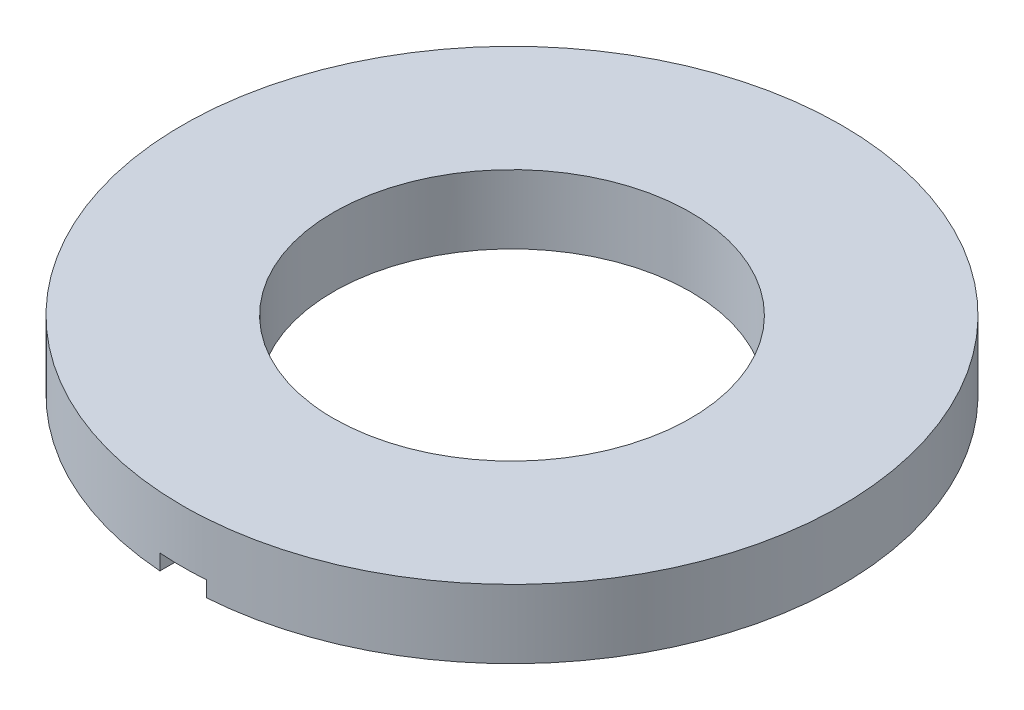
ISO-10303-21;
HEADER;
FILE_DESCRIPTION(('STEP AP214'),'2;1');
FILE_NAME('part.step','',(''),(''),'','','');
FILE_SCHEMA(('AUTOMOTIVE_DESIGN { 1 0 10303 214 1 1 1 1 }'));
ENDSEC;
DATA;
#1=APPLICATION_CONTEXT('core data for automotive mechanical design processes');
#2=APPLICATION_PROTOCOL_DEFINITION('international standard','automotive_design',2000,#1);
#3=PRODUCT_CONTEXT('',#1,'mechanical');
#4=PRODUCT('Part','Part','',(#3));
#5=PRODUCT_RELATED_PRODUCT_CATEGORY('part','',(#4));
#6=PRODUCT_DEFINITION_FORMATION('','',#4);
#7=PRODUCT_DEFINITION_CONTEXT('part definition',#1,'design');
#8=PRODUCT_DEFINITION('design','',#6,#7);
#9=PRODUCT_DEFINITION_SHAPE('','',#8);
#10=(LENGTH_UNIT() NAMED_UNIT(*) SI_UNIT(.MILLI.,.METRE.));
#11=(NAMED_UNIT(*) PLANE_ANGLE_UNIT() SI_UNIT($,.RADIAN.));
#12=(NAMED_UNIT(*) SI_UNIT($,.STERADIAN.) SOLID_ANGLE_UNIT());
#13=UNCERTAINTY_MEASURE_WITH_UNIT(LENGTH_MEASURE(1.E-05),#10,'distance_accuracy_value','');
#14=(GEOMETRIC_REPRESENTATION_CONTEXT(3) GLOBAL_UNCERTAINTY_ASSIGNED_CONTEXT((#13)) GLOBAL_UNIT_ASSIGNED_CONTEXT((#10,
#11,#12)) REPRESENTATION_CONTEXT('',''));
#15=CARTESIAN_POINT('',(0.,0.,0.));
#16=DIRECTION('',(0.,0.,1.));
#17=DIRECTION('',(1.,0.,0.));
#18=AXIS2_PLACEMENT_3D('',#15,#16,#17);
#19=CARTESIAN_POINT('',(0.,2.5,0.));
#20=DIRECTION('',(0.,1.,0.));
#21=DIRECTION('',(0.,0.,1.));
#22=AXIS2_PLACEMENT_3D('',#19,#20,#21);
#23=PLANE('',#22);
#24=CARTESIAN_POINT('',(0.,2.5,0.));
#25=DIRECTION('',(0.,1.,0.));
#26=DIRECTION('',(0.,0.,1.));
#27=AXIS2_PLACEMENT_3D('',#24,#25,#26);
#28=CIRCLE('',#27,12.);
#29=CARTESIAN_POINT('',(0.,2.5,12.));
#30=VERTEX_POINT('',#29);
#31=EDGE_CURVE('E114',#30,#30,#28,.T.);
#32=ORIENTED_EDGE('',*,*,#31,.T.);
#33=EDGE_LOOP('',(#32));
#34=FACE_BOUND('',#33,.T.);
#35=CARTESIAN_POINT('',(0.,2.5,0.));
#36=DIRECTION('',(0.,1.,0.));
#37=DIRECTION('',(0.,0.,1.));
#38=AXIS2_PLACEMENT_3D('',#35,#36,#37);
#39=CIRCLE('',#38,6.5);
#40=CARTESIAN_POINT('',(0.,2.5,6.5));
#41=VERTEX_POINT('',#40);
#42=EDGE_CURVE('E102',#41,#41,#39,.T.);
#43=ORIENTED_EDGE('',*,*,#42,.F.);
#44=EDGE_LOOP('',(#43));
#45=FACE_BOUND('',#44,.T.);
#46=ADVANCED_FACE('F39',(#34,#45),#23,.T.);
#47=CARTESIAN_POINT('',(0.,0.,0.));
#48=DIRECTION('',(0.,1.,0.));
#49=DIRECTION('',(0.,0.,1.));
#50=AXIS2_PLACEMENT_3D('',#47,#48,#49);
#51=PLANE('',#50);
#52=CARTESIAN_POINT('',(0.,0.,0.));
#53=DIRECTION('',(0.,1.,0.));
#54=DIRECTION('',(0.,0.,1.));
#55=AXIS2_PLACEMENT_3D('',#52,#53,#54);
#56=CIRCLE('',#55,12.);
#57=CARTESIAN_POINT('',(0.85,0.,11.9698579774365));
#58=VERTEX_POINT('',#57);
#59=CARTESIAN_POINT('',(-0.85,0.,11.9698579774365));
#60=VERTEX_POINT('',#59);
#61=EDGE_CURVE('E94',#58,#60,#56,.T.);
#62=ORIENTED_EDGE('',*,*,#61,.F.);
#63=DIRECTION('',(0.,0.,1.));
#64=VECTOR('',#63,1.);
#65=CARTESIAN_POINT('',(0.85,0.,1.));
#66=LINE('',#65,#64);
#67=CARTESIAN_POINT('',(0.85,0.,6.44418342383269));
#68=VERTEX_POINT('',#67);
#69=EDGE_CURVE('E81',#68,#58,#66,.T.);
#70=ORIENTED_EDGE('',*,*,#69,.F.);
#71=CARTESIAN_POINT('',(0.,0.,0.));
#72=DIRECTION('',(0.,1.,0.));
#73=DIRECTION('',(0.,0.,1.));
#74=AXIS2_PLACEMENT_3D('',#71,#72,#73);
#75=CIRCLE('',#74,6.5);
#76=CARTESIAN_POINT('',(-0.85,0.,6.44418342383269));
#77=VERTEX_POINT('',#76);
#78=EDGE_CURVE('E92',#68,#77,#75,.T.);
#79=ORIENTED_EDGE('',*,*,#78,.T.);
#80=DIRECTION('',(0.,0.,-1.));
#81=VECTOR('',#80,1.);
#82=CARTESIAN_POINT('',(-0.85,0.,1.));
#83=LINE('',#82,#81);
#84=EDGE_CURVE('E96',#60,#77,#83,.T.);
#85=ORIENTED_EDGE('',*,*,#84,.F.);
#86=EDGE_LOOP('',(#62,#70,#79,#85));
#87=FACE_BOUND('',#86,.T.);
#88=ADVANCED_FACE('F90',(#87),#51,.F.);
#89=CARTESIAN_POINT('',(0.,2.5,0.));
#90=DIRECTION('',(0.,-1.,0.));
#91=DIRECTION('',(0.,0.,-1.));
#92=AXIS2_PLACEMENT_3D('',#89,#90,#91);
#93=CYLINDRICAL_SURFACE('',#92,12.);
#94=ORIENTED_EDGE('',*,*,#31,.F.);
#95=EDGE_LOOP('',(#94));
#96=FACE_BOUND('',#95,.T.);
#97=CARTESIAN_POINT('',(0.,0.566666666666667,0.));
#98=DIRECTION('',(0.,1.,0.));
#99=DIRECTION('',(0.,0.,1.));
#100=AXIS2_PLACEMENT_3D('',#97,#98,#99);
#101=CIRCLE('',#100,12.);
#102=CARTESIAN_POINT('',(-0.85,0.566666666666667,11.9698579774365));
#103=VERTEX_POINT('',#102);
#104=CARTESIAN_POINT('',(0.85,0.566666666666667,11.9698579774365));
#105=VERTEX_POINT('',#104);
#106=EDGE_CURVE('E60',#103,#105,#101,.T.);
#107=ORIENTED_EDGE('',*,*,#106,.T.);
#108=DIRECTION('',(0.,-1.,0.));
#109=VECTOR('',#108,1.);
#110=CARTESIAN_POINT('',(0.85,2.5,11.9698579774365));
#111=LINE('',#110,#109);
#112=EDGE_CURVE('E103',#105,#58,#111,.T.);
#113=ORIENTED_EDGE('',*,*,#112,.T.);
#114=ORIENTED_EDGE('',*,*,#61,.T.);
#115=DIRECTION('',(0.,-1.,0.));
#116=VECTOR('',#115,1.);
#117=CARTESIAN_POINT('',(-0.85,2.5,11.9698579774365));
#118=LINE('',#117,#116);
#119=EDGE_CURVE('E111',#60,#103,#118,.F.);
#120=ORIENTED_EDGE('',*,*,#119,.T.);
#121=EDGE_LOOP('',(#107,#113,#114,#120));
#122=FACE_BOUND('',#121,.T.);
#123=ADVANCED_FACE('F41',(#96,#122),#93,.T.);
#124=CARTESIAN_POINT('',(0.,2.5,0.));
#125=DIRECTION('',(0.,-1.,0.));
#126=DIRECTION('',(0.,0.,-1.));
#127=AXIS2_PLACEMENT_3D('',#124,#125,#126);
#128=CYLINDRICAL_SURFACE('',#127,6.5);
#129=DIRECTION('',(0.,-1.,0.));
#130=VECTOR('',#129,1.);
#131=CARTESIAN_POINT('',(0.85,2.5,6.44418342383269));
#132=LINE('',#131,#130);
#133=CARTESIAN_POINT('',(0.85,0.566666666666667,6.44418342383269));
#134=VERTEX_POINT('',#133);
#135=EDGE_CURVE('E11',#134,#68,#132,.T.);
#136=ORIENTED_EDGE('',*,*,#135,.F.);
#137=CARTESIAN_POINT('',(0.,0.566666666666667,0.));
#138=DIRECTION('',(0.,1.,0.));
#139=DIRECTION('',(0.,0.,1.));
#140=AXIS2_PLACEMENT_3D('',#137,#138,#139);
#141=CIRCLE('',#140,6.5);
#142=CARTESIAN_POINT('',(-0.85,0.566666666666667,6.44418342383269));
#143=VERTEX_POINT('',#142);
#144=EDGE_CURVE('E117',#143,#134,#141,.T.);
#145=ORIENTED_EDGE('',*,*,#144,.F.);
#146=DIRECTION('',(0.,-1.,0.));
#147=VECTOR('',#146,1.);
#148=CARTESIAN_POINT('',(-0.85,2.5,6.44418342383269));
#149=LINE('',#148,#147);
#150=EDGE_CURVE('E48',#77,#143,#149,.F.);
#151=ORIENTED_EDGE('',*,*,#150,.F.);
#152=ORIENTED_EDGE('',*,*,#78,.F.);
#153=EDGE_LOOP('',(#136,#145,#151,#152));
#154=FACE_BOUND('',#153,.T.);
#155=ORIENTED_EDGE('',*,*,#42,.T.);
#156=EDGE_LOOP('',(#155));
#157=FACE_BOUND('',#156,.T.);
#158=ADVANCED_FACE('F99',(#154,#157),#128,.F.);
#159=CARTESIAN_POINT('',(0.85,0.566666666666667,1.));
#160=DIRECTION('',(1.,0.,0.));
#161=DIRECTION('',(0.,0.,-1.));
#162=AXIS2_PLACEMENT_3D('',#159,#160,#161);
#163=PLANE('',#162);
#164=DIRECTION('',(0.,0.,1.));
#165=VECTOR('',#164,1.);
#166=CARTESIAN_POINT('',(0.85,0.566666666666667,1.));
#167=LINE('',#166,#165);
#168=EDGE_CURVE('E83',#134,#105,#167,.T.);
#169=ORIENTED_EDGE('',*,*,#168,.F.);
#170=ORIENTED_EDGE('',*,*,#135,.T.);
#171=ORIENTED_EDGE('',*,*,#69,.T.);
#172=ORIENTED_EDGE('',*,*,#112,.F.);
#173=EDGE_LOOP('',(#169,#170,#171,#172));
#174=FACE_BOUND('',#173,.T.);
#175=ADVANCED_FACE('F79',(#174),#163,.F.);
#176=CARTESIAN_POINT('',(-0.85,0.566666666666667,1.));
#177=DIRECTION('',(-1.,0.,0.));
#178=DIRECTION('',(0.,0.,1.));
#179=AXIS2_PLACEMENT_3D('',#176,#177,#178);
#180=PLANE('',#179);
#181=ORIENTED_EDGE('',*,*,#84,.T.);
#182=ORIENTED_EDGE('',*,*,#150,.T.);
#183=DIRECTION('',(0.,0.,-1.));
#184=VECTOR('',#183,1.);
#185=CARTESIAN_POINT('',(-0.85,0.566666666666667,1.));
#186=LINE('',#185,#184);
#187=EDGE_CURVE('E55',#103,#143,#186,.T.);
#188=ORIENTED_EDGE('',*,*,#187,.F.);
#189=ORIENTED_EDGE('',*,*,#119,.F.);
#190=EDGE_LOOP('',(#181,#182,#188,#189));
#191=FACE_BOUND('',#190,.T.);
#192=ADVANCED_FACE('F124',(#191),#180,.F.);
#193=CARTESIAN_POINT('',(0.,0.566666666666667,0.));
#194=DIRECTION('',(0.,1.,0.));
#195=DIRECTION('',(0.,0.,1.));
#196=AXIS2_PLACEMENT_3D('',#193,#194,#195);
#197=PLANE('',#196);
#198=ORIENTED_EDGE('',*,*,#106,.F.);
#199=ORIENTED_EDGE('',*,*,#187,.T.);
#200=ORIENTED_EDGE('',*,*,#144,.T.);
#201=ORIENTED_EDGE('',*,*,#168,.T.);
#202=EDGE_LOOP('',(#198,#199,#200,#201));
#203=FACE_BOUND('',#202,.T.);
#204=ADVANCED_FACE('F126',(#203),#197,.F.);
#205=CLOSED_SHELL('',(#46,#88,#123,#158,#175,#192,#204));
#206=MANIFOLD_SOLID_BREP('B2',#205);
#207=ADVANCED_BREP_SHAPE_REPRESENTATION('',(#18,#206),#14);
#208=SHAPE_DEFINITION_REPRESENTATION(#9,#207);
ENDSEC;
END-ISO-10303-21;
